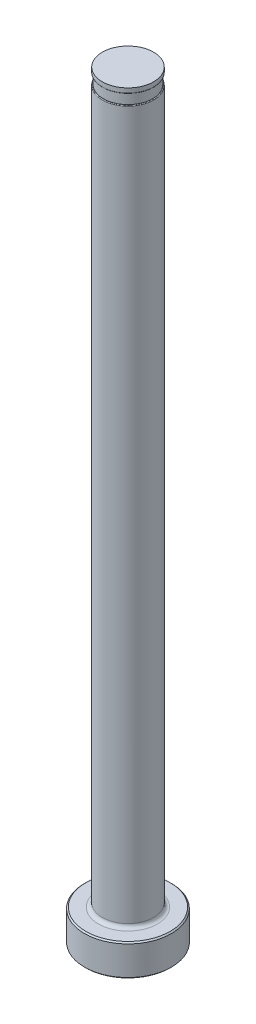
from build123d import *

# Parameters (mm, degrees)
CHAMFER1_SIZE     = 0.254
FILLET1_R         = 0.762
SKETCH2_W         = 0.2032
SKETCH2_H         = 2.032
D_SLOT_DEPTH      = 153.898684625
D_SLOT_DEPTH_BACK = 153.898684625
SKETCH5_W         = 0.00508
SKETCH5_H         = 1.016
FILLET2_R         = 0.127


with BuildPart() as part:
    # Sketch1 → Revolve1 (revolve)
    with BuildSketch(Plane.XY, mode=Mode.PRIVATE) as revolve1_sk:
        Polygon((0, 0), (-8.7249, 0), (-8.7249, 6.35), (-5.15874, 6.35), (-5.15874, 152.4), (0, 152.4), align=None)
    revolve(revolve1_sk.sketch.rotate(Axis((0, 259.958771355, 0), (0, -1, 0)), 270), axis=Axis((0, 259.958771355, 0), (0, -1, 0)))

    # Chamfer1
    chamfer1_edges = [part.edges().sort_by_distance(p)[0] for p in [
        (0, 6.35, -8.7249),
        (0, 0, -8.7249),
    ]]
    chamfer(chamfer1_edges, length=CHAMFER1_SIZE)

    # Fillet1
    fillet1_edges = [part.edges().sort_by_distance(p)[0] for p in [
        (0, 6.35, -5.15874),
    ]]
    fillet(fillet1_edges, radius=FILLET1_R)

    # Sketch2 → Vent Relief (revolve, cut)
    with BuildSketch(Plane.XY, mode=Mode.PRIVATE) as vent_relief_sk:
        with Locations((-5.05714, 150.368)):
            Rectangle(SKETCH2_W, SKETCH2_H)
    revolve(vent_relief_sk.sketch.rotate(Axis((0, 153.448281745, 0), (0, -1, 0)), 270), axis=Axis((0, 153.448281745, 0), (0, -1, 0)), mode=Mode.SUBTRACT)

    # Sketch3 → D-Slot (cut, two sides: drawn at the far end of the back side and taken through both)
    with BuildSketch(Plane.XY.offset(-D_SLOT_DEPTH_BACK)):
        with BuildLine():
            Line((-4.95554, 150.368), (-4.95554, 86.868))
            ThreePointArc((-4.95554, 86.868), (-5.006753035, 86.300038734), (-5.15874, 85.7504))
            Line((-5.15874, 85.7504), (-5.15874, 150.368))
            Line((-5.15874, 150.368), (-4.95554, 150.368))
        make_face()
    extrude(amount=D_SLOT_DEPTH + D_SLOT_DEPTH_BACK, mode=Mode.SUBTRACT)

    # Sketch5 → Vent Diameter (revolve, cut)
    with BuildSketch(Plane.XY, mode=Mode.PRIVATE) as vent_diameter_sk:
        with Locations((-5.1562, 151.892)):
            Rectangle(SKETCH5_W, SKETCH5_H)
    revolve(vent_diameter_sk.sketch.rotate(Axis((0, 152.687735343, 0), (0, -1, 0)), 90), axis=Axis((0, 152.687735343, 0), (0, -1, 0)), mode=Mode.SUBTRACT)

    # Fillet2
    fillet2_edges = [part.edges().sort_by_distance(p)[0] for p in [
        (4.123602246, 149.352, -3.099758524),
        (0, 151.384, 5.15366),
    ]]
    fillet(fillet2_edges, radius=FILLET2_R)


solid = part.part
